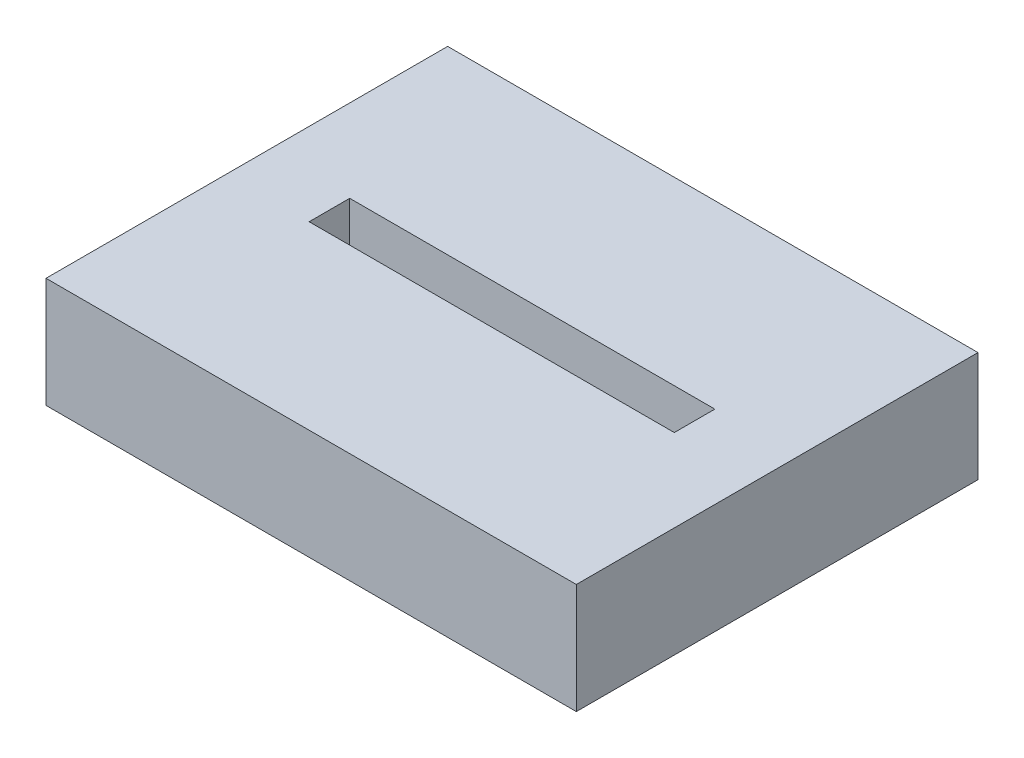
ISO-10303-21;
HEADER;
FILE_DESCRIPTION(('STEP AP214'),'2;1');
FILE_NAME('part.step','',(''),(''),'','','');
FILE_SCHEMA(('AUTOMOTIVE_DESIGN { 1 0 10303 214 1 1 1 1 }'));
ENDSEC;
DATA;
#1=APPLICATION_CONTEXT('core data for automotive mechanical design processes');
#2=APPLICATION_PROTOCOL_DEFINITION('international standard','automotive_design',2000,#1);
#3=PRODUCT_CONTEXT('',#1,'mechanical');
#4=PRODUCT('Part','Part','',(#3));
#5=PRODUCT_RELATED_PRODUCT_CATEGORY('part','',(#4));
#6=PRODUCT_DEFINITION_FORMATION('','',#4);
#7=PRODUCT_DEFINITION_CONTEXT('part definition',#1,'design');
#8=PRODUCT_DEFINITION('design','',#6,#7);
#9=PRODUCT_DEFINITION_SHAPE('','',#8);
#10=(LENGTH_UNIT() NAMED_UNIT(*) SI_UNIT(.MILLI.,.METRE.));
#11=(NAMED_UNIT(*) PLANE_ANGLE_UNIT() SI_UNIT($,.RADIAN.));
#12=(NAMED_UNIT(*) SI_UNIT($,.STERADIAN.) SOLID_ANGLE_UNIT());
#13=UNCERTAINTY_MEASURE_WITH_UNIT(LENGTH_MEASURE(1.E-05),#10,'distance_accuracy_value','');
#14=(GEOMETRIC_REPRESENTATION_CONTEXT(3) GLOBAL_UNCERTAINTY_ASSIGNED_CONTEXT((#13)) GLOBAL_UNIT_ASSIGNED_CONTEXT((#10,
#11,#12)) REPRESENTATION_CONTEXT('',''));
#15=CARTESIAN_POINT('',(0.,0.,0.));
#16=DIRECTION('',(0.,0.,1.));
#17=DIRECTION('',(1.,0.,0.));
#18=AXIS2_PLACEMENT_3D('',#15,#16,#17);
#19=CARTESIAN_POINT('',(22.875,9.5,-17.325));
#20=DIRECTION('',(-1.,0.,0.));
#21=DIRECTION('',(0.,0.,1.));
#22=AXIS2_PLACEMENT_3D('',#19,#20,#21);
#23=PLANE('',#22);
#24=DIRECTION('',(0.,0.,-1.));
#25=VECTOR('',#24,1.);
#26=CARTESIAN_POINT('',(22.875,0.,-17.325));
#27=LINE('',#26,#25);
#28=CARTESIAN_POINT('',(22.875,0.,17.325));
#29=VERTEX_POINT('',#28);
#30=CARTESIAN_POINT('',(22.875,0.,-17.325));
#31=VERTEX_POINT('',#30);
#32=EDGE_CURVE('E141',#29,#31,#27,.T.);
#33=ORIENTED_EDGE('',*,*,#32,.T.);
#34=DIRECTION('',(0.,-1.,0.));
#35=VECTOR('',#34,1.);
#36=CARTESIAN_POINT('',(22.875,9.5,-17.325));
#37=LINE('',#36,#35);
#38=CARTESIAN_POINT('',(22.875,9.5,-17.325));
#39=VERTEX_POINT('',#38);
#40=EDGE_CURVE('E11',#39,#31,#37,.T.);
#41=ORIENTED_EDGE('',*,*,#40,.F.);
#42=DIRECTION('',(0.,0.,-1.));
#43=VECTOR('',#42,1.);
#44=CARTESIAN_POINT('',(22.875,9.5,-17.325));
#45=LINE('',#44,#43);
#46=CARTESIAN_POINT('',(22.875,9.5,17.325));
#47=VERTEX_POINT('',#46);
#48=EDGE_CURVE('E145',#47,#39,#45,.T.);
#49=ORIENTED_EDGE('',*,*,#48,.F.);
#50=DIRECTION('',(0.,-1.,0.));
#51=VECTOR('',#50,1.);
#52=CARTESIAN_POINT('',(22.875,9.5,17.325));
#53=LINE('',#52,#51);
#54=EDGE_CURVE('E151',#47,#29,#53,.T.);
#55=ORIENTED_EDGE('',*,*,#54,.T.);
#56=EDGE_LOOP('',(#33,#41,#49,#55));
#57=FACE_BOUND('',#56,.T.);
#58=ADVANCED_FACE('F33',(#57),#23,.F.);
#59=CARTESIAN_POINT('',(-22.875,9.5,-17.325));
#60=DIRECTION('',(0.,0.,1.));
#61=DIRECTION('',(1.,0.,0.));
#62=AXIS2_PLACEMENT_3D('',#59,#60,#61);
#63=PLANE('',#62);
#64=DIRECTION('',(-1.,0.,0.));
#65=VECTOR('',#64,1.);
#66=CARTESIAN_POINT('',(-22.875,0.,-17.325));
#67=LINE('',#66,#65);
#68=CARTESIAN_POINT('',(-22.875,0.,-17.325));
#69=VERTEX_POINT('',#68);
#70=EDGE_CURVE('E154',#31,#69,#67,.T.);
#71=ORIENTED_EDGE('',*,*,#70,.T.);
#72=DIRECTION('',(0.,-1.,0.));
#73=VECTOR('',#72,1.);
#74=CARTESIAN_POINT('',(-22.875,9.5,-17.325));
#75=LINE('',#74,#73);
#76=CARTESIAN_POINT('',(-22.875,9.5,-17.325));
#77=VERTEX_POINT('',#76);
#78=EDGE_CURVE('E40',#77,#69,#75,.T.);
#79=ORIENTED_EDGE('',*,*,#78,.F.);
#80=DIRECTION('',(-1.,0.,0.));
#81=VECTOR('',#80,1.);
#82=CARTESIAN_POINT('',(-22.875,9.5,-17.325));
#83=LINE('',#82,#81);
#84=EDGE_CURVE('E84',#39,#77,#83,.T.);
#85=ORIENTED_EDGE('',*,*,#84,.F.);
#86=ORIENTED_EDGE('',*,*,#40,.T.);
#87=EDGE_LOOP('',(#71,#79,#85,#86));
#88=FACE_BOUND('',#87,.T.);
#89=ADVANCED_FACE('F183',(#88),#63,.F.);
#90=CARTESIAN_POINT('',(-22.875,9.5,-17.325));
#91=DIRECTION('',(1.,0.,0.));
#92=DIRECTION('',(0.,0.,-1.));
#93=AXIS2_PLACEMENT_3D('',#90,#91,#92);
#94=PLANE('',#93);
#95=DIRECTION('',(0.,0.,1.));
#96=VECTOR('',#95,1.);
#97=CARTESIAN_POINT('',(-22.875,0.,-17.325));
#98=LINE('',#97,#96);
#99=CARTESIAN_POINT('',(-22.875,0.,17.325));
#100=VERTEX_POINT('',#99);
#101=EDGE_CURVE('E156',#69,#100,#98,.T.);
#102=ORIENTED_EDGE('',*,*,#101,.T.);
#103=DIRECTION('',(0.,-1.,0.));
#104=VECTOR('',#103,1.);
#105=CARTESIAN_POINT('',(-22.875,9.5,17.325));
#106=LINE('',#105,#104);
#107=CARTESIAN_POINT('',(-22.875,9.5,17.325));
#108=VERTEX_POINT('',#107);
#109=EDGE_CURVE('E160',#108,#100,#106,.T.);
#110=ORIENTED_EDGE('',*,*,#109,.F.);
#111=DIRECTION('',(0.,0.,1.));
#112=VECTOR('',#111,1.);
#113=CARTESIAN_POINT('',(-22.875,9.5,-17.325));
#114=LINE('',#113,#112);
#115=EDGE_CURVE('E148',#77,#108,#114,.T.);
#116=ORIENTED_EDGE('',*,*,#115,.F.);
#117=ORIENTED_EDGE('',*,*,#78,.T.);
#118=EDGE_LOOP('',(#102,#110,#116,#117));
#119=FACE_BOUND('',#118,.T.);
#120=ADVANCED_FACE('F165',(#119),#94,.F.);
#121=CARTESIAN_POINT('',(-22.875,9.5,17.325));
#122=DIRECTION('',(0.,0.,-1.));
#123=DIRECTION('',(-1.,0.,0.));
#124=AXIS2_PLACEMENT_3D('',#121,#122,#123);
#125=PLANE('',#124);
#126=DIRECTION('',(1.,0.,0.));
#127=VECTOR('',#126,1.);
#128=CARTESIAN_POINT('',(-22.875,0.,17.325));
#129=LINE('',#128,#127);
#130=EDGE_CURVE('E77',#100,#29,#129,.T.);
#131=ORIENTED_EDGE('',*,*,#130,.T.);
#132=ORIENTED_EDGE('',*,*,#54,.F.);
#133=DIRECTION('',(1.,0.,0.));
#134=VECTOR('',#133,1.);
#135=CARTESIAN_POINT('',(-22.875,9.5,17.325));
#136=LINE('',#135,#134);
#137=EDGE_CURVE('E56',#108,#47,#136,.T.);
#138=ORIENTED_EDGE('',*,*,#137,.F.);
#139=ORIENTED_EDGE('',*,*,#109,.T.);
#140=EDGE_LOOP('',(#131,#132,#138,#139));
#141=FACE_BOUND('',#140,.T.);
#142=ADVANCED_FACE('F173',(#141),#125,.F.);
#143=CARTESIAN_POINT('',(0.,9.5,0.));
#144=DIRECTION('',(0.,1.,0.));
#145=DIRECTION('',(0.,0.,1.));
#146=AXIS2_PLACEMENT_3D('',#143,#144,#145);
#147=PLANE('',#146);
#148=DIRECTION('',(0.,0.,-1.));
#149=VECTOR('',#148,1.);
#150=CARTESIAN_POINT('',(15.75,9.5,-1.75));
#151=LINE('',#150,#149);
#152=CARTESIAN_POINT('',(15.75,9.5,1.75));
#153=VERTEX_POINT('',#152);
#154=CARTESIAN_POINT('',(15.75,9.5,-1.75));
#155=VERTEX_POINT('',#154);
#156=EDGE_CURVE('E47',#153,#155,#151,.T.);
#157=ORIENTED_EDGE('',*,*,#156,.F.);
#158=DIRECTION('',(1.,0.,0.));
#159=VECTOR('',#158,1.);
#160=CARTESIAN_POINT('',(-15.75,9.5,1.75));
#161=LINE('',#160,#159);
#162=CARTESIAN_POINT('',(-15.75,9.5,1.75));
#163=VERTEX_POINT('',#162);
#164=EDGE_CURVE('E126',#163,#153,#161,.T.);
#165=ORIENTED_EDGE('',*,*,#164,.F.);
#166=DIRECTION('',(0.,0.,1.));
#167=VECTOR('',#166,1.);
#168=CARTESIAN_POINT('',(-15.75,9.5,-1.75));
#169=LINE('',#168,#167);
#170=CARTESIAN_POINT('',(-15.75,9.5,-1.75));
#171=VERTEX_POINT('',#170);
#172=EDGE_CURVE('E129',#171,#163,#169,.T.);
#173=ORIENTED_EDGE('',*,*,#172,.F.);
#174=DIRECTION('',(-1.,0.,0.));
#175=VECTOR('',#174,1.);
#176=CARTESIAN_POINT('',(-15.75,9.5,-1.75));
#177=LINE('',#176,#175);
#178=EDGE_CURVE('E135',#155,#171,#177,.T.);
#179=ORIENTED_EDGE('',*,*,#178,.F.);
#180=EDGE_LOOP('',(#157,#165,#173,#179));
#181=FACE_BOUND('',#180,.T.);
#182=ORIENTED_EDGE('',*,*,#48,.T.);
#183=ORIENTED_EDGE('',*,*,#84,.T.);
#184=ORIENTED_EDGE('',*,*,#115,.T.);
#185=ORIENTED_EDGE('',*,*,#137,.T.);
#186=EDGE_LOOP('',(#182,#183,#184,#185));
#187=FACE_BOUND('',#186,.T.);
#188=ADVANCED_FACE('F175',(#181,#187),#147,.T.);
#189=CARTESIAN_POINT('',(0.,0.,0.));
#190=DIRECTION('',(0.,1.,0.));
#191=DIRECTION('',(0.,0.,1.));
#192=AXIS2_PLACEMENT_3D('',#189,#190,#191);
#193=PLANE('',#192);
#194=ORIENTED_EDGE('',*,*,#32,.F.);
#195=ORIENTED_EDGE('',*,*,#130,.F.);
#196=ORIENTED_EDGE('',*,*,#101,.F.);
#197=ORIENTED_EDGE('',*,*,#70,.F.);
#198=EDGE_LOOP('',(#194,#195,#196,#197));
#199=FACE_BOUND('',#198,.T.);
#200=ADVANCED_FACE('F169',(#199),#193,.F.);
#201=CARTESIAN_POINT('',(15.75,4.5,-1.75));
#202=DIRECTION('',(1.,0.,0.));
#203=DIRECTION('',(0.,0.,-1.));
#204=AXIS2_PLACEMENT_3D('',#201,#202,#203);
#205=PLANE('',#204);
#206=ORIENTED_EDGE('',*,*,#156,.T.);
#207=DIRECTION('',(0.,1.,0.));
#208=VECTOR('',#207,1.);
#209=CARTESIAN_POINT('',(15.75,4.5,-1.75));
#210=LINE('',#209,#208);
#211=CARTESIAN_POINT('',(15.75,4.5,-1.75));
#212=VERTEX_POINT('',#211);
#213=EDGE_CURVE('E104',#212,#155,#210,.T.);
#214=ORIENTED_EDGE('',*,*,#213,.F.);
#215=DIRECTION('',(0.,0.,-1.));
#216=VECTOR('',#215,1.);
#217=CARTESIAN_POINT('',(15.75,4.5,-1.75));
#218=LINE('',#217,#216);
#219=CARTESIAN_POINT('',(15.75,4.5,1.75));
#220=VERTEX_POINT('',#219);
#221=EDGE_CURVE('E108',#220,#212,#218,.T.);
#222=ORIENTED_EDGE('',*,*,#221,.F.);
#223=DIRECTION('',(0.,1.,0.));
#224=VECTOR('',#223,1.);
#225=CARTESIAN_POINT('',(15.75,4.5,1.75));
#226=LINE('',#225,#224);
#227=EDGE_CURVE('E139',#220,#153,#226,.T.);
#228=ORIENTED_EDGE('',*,*,#227,.T.);
#229=EDGE_LOOP('',(#206,#214,#222,#228));
#230=FACE_BOUND('',#229,.T.);
#231=ADVANCED_FACE('F106',(#230),#205,.F.);
#232=CARTESIAN_POINT('',(-15.75,4.5,1.75));
#233=DIRECTION('',(0.,0.,1.));
#234=DIRECTION('',(1.,0.,0.));
#235=AXIS2_PLACEMENT_3D('',#232,#233,#234);
#236=PLANE('',#235);
#237=ORIENTED_EDGE('',*,*,#164,.T.);
#238=ORIENTED_EDGE('',*,*,#227,.F.);
#239=DIRECTION('',(1.,0.,0.));
#240=VECTOR('',#239,1.);
#241=CARTESIAN_POINT('',(-15.75,4.5,1.75));
#242=LINE('',#241,#240);
#243=CARTESIAN_POINT('',(-15.75,4.5,1.75));
#244=VERTEX_POINT('',#243);
#245=EDGE_CURVE('E114',#244,#220,#242,.T.);
#246=ORIENTED_EDGE('',*,*,#245,.F.);
#247=DIRECTION('',(0.,1.,0.));
#248=VECTOR('',#247,1.);
#249=CARTESIAN_POINT('',(-15.75,4.5,1.75));
#250=LINE('',#249,#248);
#251=EDGE_CURVE('E142',#244,#163,#250,.T.);
#252=ORIENTED_EDGE('',*,*,#251,.T.);
#253=EDGE_LOOP('',(#237,#238,#246,#252));
#254=FACE_BOUND('',#253,.T.);
#255=ADVANCED_FACE('F222',(#254),#236,.F.);
#256=CARTESIAN_POINT('',(-15.75,4.5,-1.75));
#257=DIRECTION('',(-1.,0.,0.));
#258=DIRECTION('',(0.,0.,1.));
#259=AXIS2_PLACEMENT_3D('',#256,#257,#258);
#260=PLANE('',#259);
#261=ORIENTED_EDGE('',*,*,#172,.T.);
#262=ORIENTED_EDGE('',*,*,#251,.F.);
#263=DIRECTION('',(0.,0.,1.));
#264=VECTOR('',#263,1.);
#265=CARTESIAN_POINT('',(-15.75,4.5,-1.75));
#266=LINE('',#265,#264);
#267=CARTESIAN_POINT('',(-15.75,4.5,-1.75));
#268=VERTEX_POINT('',#267);
#269=EDGE_CURVE('E122',#268,#244,#266,.T.);
#270=ORIENTED_EDGE('',*,*,#269,.F.);
#271=DIRECTION('',(0.,1.,0.));
#272=VECTOR('',#271,1.);
#273=CARTESIAN_POINT('',(-15.75,4.5,-1.75));
#274=LINE('',#273,#272);
#275=EDGE_CURVE('E113',#268,#171,#274,.T.);
#276=ORIENTED_EDGE('',*,*,#275,.T.);
#277=EDGE_LOOP('',(#261,#262,#270,#276));
#278=FACE_BOUND('',#277,.T.);
#279=ADVANCED_FACE('F231',(#278),#260,.F.);
#280=CARTESIAN_POINT('',(-15.75,4.5,-1.75));
#281=DIRECTION('',(0.,0.,-1.));
#282=DIRECTION('',(-1.,0.,0.));
#283=AXIS2_PLACEMENT_3D('',#280,#281,#282);
#284=PLANE('',#283);
#285=ORIENTED_EDGE('',*,*,#178,.T.);
#286=ORIENTED_EDGE('',*,*,#275,.F.);
#287=DIRECTION('',(-1.,0.,0.));
#288=VECTOR('',#287,1.);
#289=CARTESIAN_POINT('',(-15.75,4.5,-1.75));
#290=LINE('',#289,#288);
#291=EDGE_CURVE('E117',#212,#268,#290,.T.);
#292=ORIENTED_EDGE('',*,*,#291,.F.);
#293=ORIENTED_EDGE('',*,*,#213,.T.);
#294=EDGE_LOOP('',(#285,#286,#292,#293));
#295=FACE_BOUND('',#294,.T.);
#296=ADVANCED_FACE('F118',(#295),#284,.F.);
#297=CARTESIAN_POINT('',(0.,4.5,0.));
#298=DIRECTION('',(0.,1.,0.));
#299=DIRECTION('',(0.,0.,1.));
#300=AXIS2_PLACEMENT_3D('',#297,#298,#299);
#301=PLANE('',#300);
#302=ORIENTED_EDGE('',*,*,#221,.T.);
#303=ORIENTED_EDGE('',*,*,#291,.T.);
#304=ORIENTED_EDGE('',*,*,#269,.T.);
#305=ORIENTED_EDGE('',*,*,#245,.T.);
#306=EDGE_LOOP('',(#302,#303,#304,#305));
#307=FACE_BOUND('',#306,.T.);
#308=ADVANCED_FACE('F124',(#307),#301,.T.);
#309=CLOSED_SHELL('',(#58,#89,#120,#142,#188,#200,#231,#255,#279,#296,#308));
#310=MANIFOLD_SOLID_BREP('B2',#309);
#311=ADVANCED_BREP_SHAPE_REPRESENTATION('',(#18,#310),#14);
#312=SHAPE_DEFINITION_REPRESENTATION(#9,#311);
ENDSEC;
END-ISO-10303-21;
